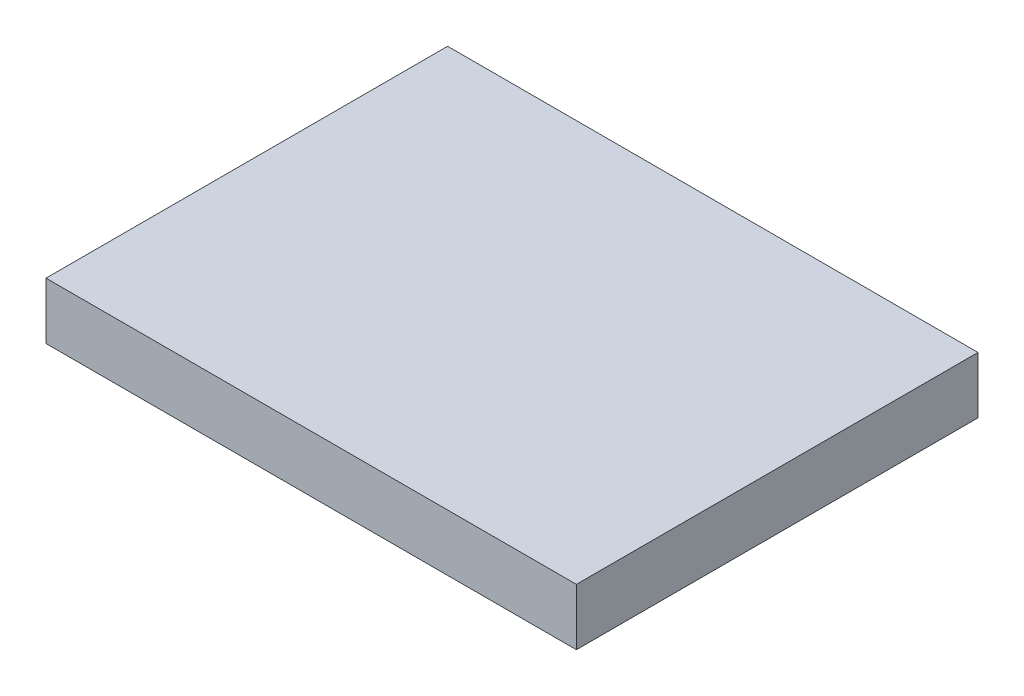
ISO-10303-21;
HEADER;
FILE_DESCRIPTION(('STEP AP214'),'2;1');
FILE_NAME('part.step','',(''),(''),'','','');
FILE_SCHEMA(('AUTOMOTIVE_DESIGN { 1 0 10303 214 1 1 1 1 }'));
ENDSEC;
DATA;
#1=APPLICATION_CONTEXT('core data for automotive mechanical design processes');
#2=APPLICATION_PROTOCOL_DEFINITION('international standard','automotive_design',2000,#1);
#3=PRODUCT_CONTEXT('',#1,'mechanical');
#4=PRODUCT('Part','Part','',(#3));
#5=PRODUCT_RELATED_PRODUCT_CATEGORY('part','',(#4));
#6=PRODUCT_DEFINITION_FORMATION('','',#4);
#7=PRODUCT_DEFINITION_CONTEXT('part definition',#1,'design');
#8=PRODUCT_DEFINITION('design','',#6,#7);
#9=PRODUCT_DEFINITION_SHAPE('','',#8);
#10=(LENGTH_UNIT() NAMED_UNIT(*) SI_UNIT(.MILLI.,.METRE.));
#11=(NAMED_UNIT(*) PLANE_ANGLE_UNIT() SI_UNIT($,.RADIAN.));
#12=(NAMED_UNIT(*) SI_UNIT($,.STERADIAN.) SOLID_ANGLE_UNIT());
#13=UNCERTAINTY_MEASURE_WITH_UNIT(LENGTH_MEASURE(1.E-05),#10,'distance_accuracy_value','');
#14=(GEOMETRIC_REPRESENTATION_CONTEXT(3) GLOBAL_UNCERTAINTY_ASSIGNED_CONTEXT((#13)) GLOBAL_UNIT_ASSIGNED_CONTEXT((#10,
#11,#12)) REPRESENTATION_CONTEXT('',''));
#15=CARTESIAN_POINT('',(0.,0.,0.));
#16=DIRECTION('',(0.,0.,1.));
#17=DIRECTION('',(1.,0.,0.));
#18=AXIS2_PLACEMENT_3D('',#15,#16,#17);
#19=CARTESIAN_POINT('',(103.,22.,78.));
#20=DIRECTION('',(-1.,0.,0.));
#21=DIRECTION('',(0.,0.,1.));
#22=AXIS2_PLACEMENT_3D('',#19,#20,#21);
#23=PLANE('',#22);
#24=DIRECTION('',(0.,0.,-1.));
#25=VECTOR('',#24,1.);
#26=CARTESIAN_POINT('',(103.,0.,78.));
#27=LINE('',#26,#25);
#28=CARTESIAN_POINT('',(103.,0.,78.));
#29=VERTEX_POINT('',#28);
#30=CARTESIAN_POINT('',(103.,0.,-78.));
#31=VERTEX_POINT('',#30);
#32=EDGE_CURVE('E94',#29,#31,#27,.T.);
#33=ORIENTED_EDGE('',*,*,#32,.T.);
#34=DIRECTION('',(0.,-1.,0.));
#35=VECTOR('',#34,1.);
#36=CARTESIAN_POINT('',(103.,22.,-78.));
#37=LINE('',#36,#35);
#38=CARTESIAN_POINT('',(103.,22.,-78.));
#39=VERTEX_POINT('',#38);
#40=EDGE_CURVE('E11',#39,#31,#37,.T.);
#41=ORIENTED_EDGE('',*,*,#40,.F.);
#42=DIRECTION('',(0.,0.,-1.));
#43=VECTOR('',#42,1.);
#44=CARTESIAN_POINT('',(103.,22.,78.));
#45=LINE('',#44,#43);
#46=CARTESIAN_POINT('',(103.,22.,78.));
#47=VERTEX_POINT('',#46);
#48=EDGE_CURVE('E82',#47,#39,#45,.T.);
#49=ORIENTED_EDGE('',*,*,#48,.F.);
#50=DIRECTION('',(0.,-1.,0.));
#51=VECTOR('',#50,1.);
#52=CARTESIAN_POINT('',(103.,22.,78.));
#53=LINE('',#52,#51);
#54=EDGE_CURVE('E90',#47,#29,#53,.T.);
#55=ORIENTED_EDGE('',*,*,#54,.T.);
#56=EDGE_LOOP('',(#33,#41,#49,#55));
#57=FACE_BOUND('',#56,.T.);
#58=ADVANCED_FACE('F31',(#57),#23,.F.);
#59=CARTESIAN_POINT('',(-103.,22.,-78.));
#60=DIRECTION('',(0.,0.,1.));
#61=DIRECTION('',(1.,0.,0.));
#62=AXIS2_PLACEMENT_3D('',#59,#60,#61);
#63=PLANE('',#62);
#64=DIRECTION('',(-1.,0.,0.));
#65=VECTOR('',#64,1.);
#66=CARTESIAN_POINT('',(-103.,0.,-78.));
#67=LINE('',#66,#65);
#68=CARTESIAN_POINT('',(-103.,0.,-78.));
#69=VERTEX_POINT('',#68);
#70=EDGE_CURVE('E86',#31,#69,#67,.T.);
#71=ORIENTED_EDGE('',*,*,#70,.T.);
#72=DIRECTION('',(0.,-1.,0.));
#73=VECTOR('',#72,1.);
#74=CARTESIAN_POINT('',(-103.,22.,-78.));
#75=LINE('',#74,#73);
#76=CARTESIAN_POINT('',(-103.,22.,-78.));
#77=VERTEX_POINT('',#76);
#78=EDGE_CURVE('E39',#77,#69,#75,.T.);
#79=ORIENTED_EDGE('',*,*,#78,.F.);
#80=DIRECTION('',(-1.,0.,0.));
#81=VECTOR('',#80,1.);
#82=CARTESIAN_POINT('',(-103.,22.,-78.));
#83=LINE('',#82,#81);
#84=EDGE_CURVE('E77',#39,#77,#83,.T.);
#85=ORIENTED_EDGE('',*,*,#84,.F.);
#86=ORIENTED_EDGE('',*,*,#40,.T.);
#87=EDGE_LOOP('',(#71,#79,#85,#86));
#88=FACE_BOUND('',#87,.T.);
#89=ADVANCED_FACE('F85',(#88),#63,.F.);
#90=CARTESIAN_POINT('',(-103.,22.,78.));
#91=DIRECTION('',(1.,0.,0.));
#92=DIRECTION('',(0.,0.,-1.));
#93=AXIS2_PLACEMENT_3D('',#90,#91,#92);
#94=PLANE('',#93);
#95=DIRECTION('',(0.,0.,1.));
#96=VECTOR('',#95,1.);
#97=CARTESIAN_POINT('',(-103.,0.,78.));
#98=LINE('',#97,#96);
#99=CARTESIAN_POINT('',(-103.,0.,78.));
#100=VERTEX_POINT('',#99);
#101=EDGE_CURVE('E64',#69,#100,#98,.T.);
#102=ORIENTED_EDGE('',*,*,#101,.T.);
#103=DIRECTION('',(0.,-1.,0.));
#104=VECTOR('',#103,1.);
#105=CARTESIAN_POINT('',(-103.,22.,78.));
#106=LINE('',#105,#104);
#107=CARTESIAN_POINT('',(-103.,22.,78.));
#108=VERTEX_POINT('',#107);
#109=EDGE_CURVE('E87',#108,#100,#106,.T.);
#110=ORIENTED_EDGE('',*,*,#109,.F.);
#111=DIRECTION('',(0.,0.,1.));
#112=VECTOR('',#111,1.);
#113=CARTESIAN_POINT('',(-103.,22.,78.));
#114=LINE('',#113,#112);
#115=EDGE_CURVE('E80',#77,#108,#114,.T.);
#116=ORIENTED_EDGE('',*,*,#115,.F.);
#117=ORIENTED_EDGE('',*,*,#78,.T.);
#118=EDGE_LOOP('',(#102,#110,#116,#117));
#119=FACE_BOUND('',#118,.T.);
#120=ADVANCED_FACE('F88',(#119),#94,.F.);
#121=CARTESIAN_POINT('',(-103.,22.,78.));
#122=DIRECTION('',(0.,0.,-1.));
#123=DIRECTION('',(-1.,0.,0.));
#124=AXIS2_PLACEMENT_3D('',#121,#122,#123);
#125=PLANE('',#124);
#126=DIRECTION('',(1.,0.,0.));
#127=VECTOR('',#126,1.);
#128=CARTESIAN_POINT('',(-103.,0.,78.));
#129=LINE('',#128,#127);
#130=EDGE_CURVE('E70',#100,#29,#129,.T.);
#131=ORIENTED_EDGE('',*,*,#130,.T.);
#132=ORIENTED_EDGE('',*,*,#54,.F.);
#133=DIRECTION('',(1.,0.,0.));
#134=VECTOR('',#133,1.);
#135=CARTESIAN_POINT('',(-103.,22.,78.));
#136=LINE('',#135,#134);
#137=EDGE_CURVE('E47',#108,#47,#136,.T.);
#138=ORIENTED_EDGE('',*,*,#137,.F.);
#139=ORIENTED_EDGE('',*,*,#109,.T.);
#140=EDGE_LOOP('',(#131,#132,#138,#139));
#141=FACE_BOUND('',#140,.T.);
#142=ADVANCED_FACE('F101',(#141),#125,.F.);
#143=CARTESIAN_POINT('',(103.,22.,-78.));
#144=DIRECTION('',(0.,-1.,0.));
#145=DIRECTION('',(0.,0.,-1.));
#146=AXIS2_PLACEMENT_3D('',#143,#144,#145);
#147=PLANE('',#146);
#148=ORIENTED_EDGE('',*,*,#48,.T.);
#149=ORIENTED_EDGE('',*,*,#84,.T.);
#150=ORIENTED_EDGE('',*,*,#115,.T.);
#151=ORIENTED_EDGE('',*,*,#137,.T.);
#152=EDGE_LOOP('',(#148,#149,#150,#151));
#153=FACE_BOUND('',#152,.T.);
#154=ADVANCED_FACE('F78',(#153),#147,.F.);
#155=CARTESIAN_POINT('',(103.,0.,-78.));
#156=DIRECTION('',(0.,-1.,0.));
#157=DIRECTION('',(0.,0.,-1.));
#158=AXIS2_PLACEMENT_3D('',#155,#156,#157);
#159=PLANE('',#158);
#160=ORIENTED_EDGE('',*,*,#32,.F.);
#161=ORIENTED_EDGE('',*,*,#130,.F.);
#162=ORIENTED_EDGE('',*,*,#101,.F.);
#163=ORIENTED_EDGE('',*,*,#70,.F.);
#164=EDGE_LOOP('',(#160,#161,#162,#163));
#165=FACE_BOUND('',#164,.T.);
#166=ADVANCED_FACE('F104',(#165),#159,.T.);
#167=CLOSED_SHELL('',(#58,#89,#120,#142,#154,#166));
#168=MANIFOLD_SOLID_BREP('B2',#167);
#169=ADVANCED_BREP_SHAPE_REPRESENTATION('',(#18,#168),#14);
#170=SHAPE_DEFINITION_REPRESENTATION(#9,#169);
ENDSEC;
END-ISO-10303-21;
